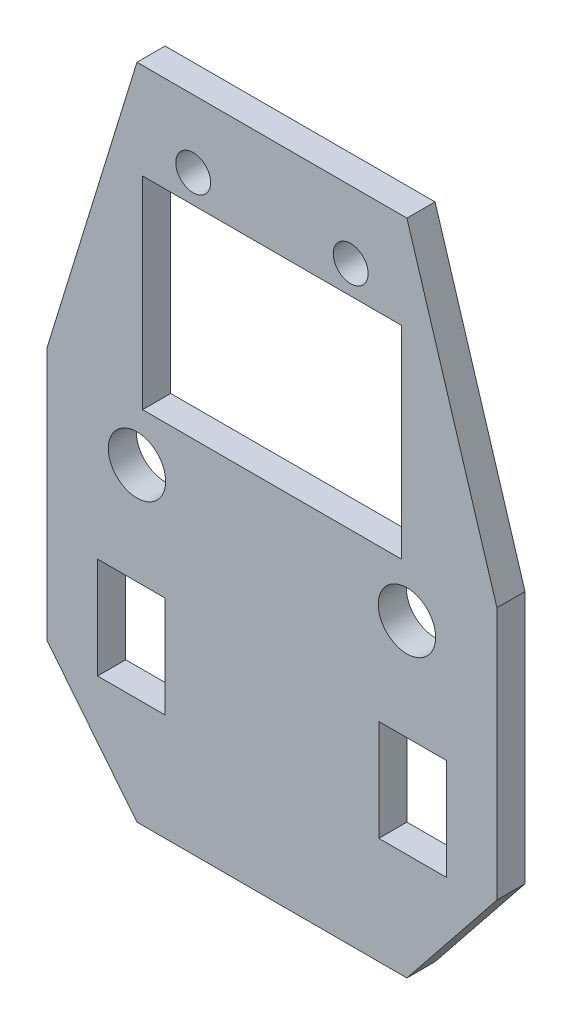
ISO-10303-21;
HEADER;
FILE_DESCRIPTION(('STEP AP214'),'2;1');
FILE_NAME('part.step','',(''),(''),'','','');
FILE_SCHEMA(('AUTOMOTIVE_DESIGN { 1 0 10303 214 1 1 1 1 }'));
ENDSEC;
DATA;
#1=APPLICATION_CONTEXT('core data for automotive mechanical design processes');
#2=APPLICATION_PROTOCOL_DEFINITION('international standard','automotive_design',2000,#1);
#3=PRODUCT_CONTEXT('',#1,'mechanical');
#4=PRODUCT('Part','Part','',(#3));
#5=PRODUCT_RELATED_PRODUCT_CATEGORY('part','',(#4));
#6=PRODUCT_DEFINITION_FORMATION('','',#4);
#7=PRODUCT_DEFINITION_CONTEXT('part definition',#1,'design');
#8=PRODUCT_DEFINITION('design','',#6,#7);
#9=PRODUCT_DEFINITION_SHAPE('','',#8);
#10=(LENGTH_UNIT() NAMED_UNIT(*) SI_UNIT(.MILLI.,.METRE.));
#11=(NAMED_UNIT(*) PLANE_ANGLE_UNIT() SI_UNIT($,.RADIAN.));
#12=(NAMED_UNIT(*) SI_UNIT($,.STERADIAN.) SOLID_ANGLE_UNIT());
#13=UNCERTAINTY_MEASURE_WITH_UNIT(LENGTH_MEASURE(1.E-05),#10,'distance_accuracy_value','');
#14=(GEOMETRIC_REPRESENTATION_CONTEXT(3) GLOBAL_UNCERTAINTY_ASSIGNED_CONTEXT((#13)) GLOBAL_UNIT_ASSIGNED_CONTEXT((#10,
#11,#12)) REPRESENTATION_CONTEXT('',''));
#15=CARTESIAN_POINT('',(0.,0.,0.));
#16=DIRECTION('',(0.,0.,1.));
#17=DIRECTION('',(1.,0.,0.));
#18=AXIS2_PLACEMENT_3D('',#15,#16,#17);
#19=CARTESIAN_POINT('',(-40.,10.,-2.5));
#20=DIRECTION('',(-1.,0.,0.));
#21=DIRECTION('',(0.,0.,1.));
#22=AXIS2_PLACEMENT_3D('',#19,#20,#21);
#23=PLANE('',#22);
#24=DIRECTION('',(0.,-1.,0.));
#25=VECTOR('',#24,1.);
#26=CARTESIAN_POINT('',(-40.,10.,2.5));
#27=LINE('',#26,#25);
#28=CARTESIAN_POINT('',(-40.,10.,2.5));
#29=VERTEX_POINT('',#28);
#30=CARTESIAN_POINT('',(-40.,-35.,2.5));
#31=VERTEX_POINT('',#30);
#32=EDGE_CURVE('E248',#29,#31,#27,.T.);
#33=ORIENTED_EDGE('',*,*,#32,.F.);
#34=DIRECTION('',(0.,0.,1.));
#35=VECTOR('',#34,1.);
#36=CARTESIAN_POINT('',(-40.,10.,-2.5));
#37=LINE('',#36,#35);
#38=CARTESIAN_POINT('',(-40.,10.,-2.5));
#39=VERTEX_POINT('',#38);
#40=EDGE_CURVE('E297',#39,#29,#37,.T.);
#41=ORIENTED_EDGE('',*,*,#40,.F.);
#42=DIRECTION('',(0.,-1.,0.));
#43=VECTOR('',#42,1.);
#44=CARTESIAN_POINT('',(-40.,10.,-2.5));
#45=LINE('',#44,#43);
#46=CARTESIAN_POINT('',(-40.,-35.,-2.5));
#47=VERTEX_POINT('',#46);
#48=EDGE_CURVE('E249',#39,#47,#45,.T.);
#49=ORIENTED_EDGE('',*,*,#48,.T.);
#50=DIRECTION('',(0.,0.,1.));
#51=VECTOR('',#50,1.);
#52=CARTESIAN_POINT('',(-40.,-35.,-2.5));
#53=LINE('',#52,#51);
#54=EDGE_CURVE('E274',#47,#31,#53,.T.);
#55=ORIENTED_EDGE('',*,*,#54,.T.);
#56=EDGE_LOOP('',(#33,#41,#49,#55));
#57=FACE_BOUND('',#56,.T.);
#58=ADVANCED_FACE('F41',(#57),#23,.T.);
#59=CARTESIAN_POINT('',(-24.,62.,-2.5));
#60=DIRECTION('',(-0.95577900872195,0.294085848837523,0.));
#61=DIRECTION('',(-0.294085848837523,-0.95577900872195,0.));
#62=AXIS2_PLACEMENT_3D('',#59,#60,#61);
#63=PLANE('',#62);
#64=DIRECTION('',(-0.294085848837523,-0.95577900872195,0.));
#65=VECTOR('',#64,1.);
#66=CARTESIAN_POINT('',(-24.,62.,2.5));
#67=LINE('',#66,#65);
#68=CARTESIAN_POINT('',(-24.,62.,2.5));
#69=VERTEX_POINT('',#68);
#70=EDGE_CURVE('E253',#69,#29,#67,.T.);
#71=ORIENTED_EDGE('',*,*,#70,.F.);
#72=DIRECTION('',(0.,0.,1.));
#73=VECTOR('',#72,1.);
#74=CARTESIAN_POINT('',(-24.,62.,-2.5));
#75=LINE('',#74,#73);
#76=CARTESIAN_POINT('',(-24.,62.,-2.5));
#77=VERTEX_POINT('',#76);
#78=EDGE_CURVE('E300',#77,#69,#75,.T.);
#79=ORIENTED_EDGE('',*,*,#78,.F.);
#80=DIRECTION('',(-0.294085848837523,-0.95577900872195,0.));
#81=VECTOR('',#80,1.);
#82=CARTESIAN_POINT('',(-24.,62.,-2.5));
#83=LINE('',#82,#81);
#84=EDGE_CURVE('E271',#77,#39,#83,.T.);
#85=ORIENTED_EDGE('',*,*,#84,.T.);
#86=ORIENTED_EDGE('',*,*,#40,.T.);
#87=EDGE_LOOP('',(#71,#79,#85,#86));
#88=FACE_BOUND('',#87,.T.);
#89=ADVANCED_FACE('F425',(#88),#63,.T.);
#90=CARTESIAN_POINT('',(24.,62.,-2.5));
#91=DIRECTION('',(0.,1.,0.));
#92=DIRECTION('',(0.,0.,1.));
#93=AXIS2_PLACEMENT_3D('',#90,#91,#92);
#94=PLANE('',#93);
#95=DIRECTION('',(-1.,0.,0.));
#96=VECTOR('',#95,1.);
#97=CARTESIAN_POINT('',(24.,62.,2.5));
#98=LINE('',#97,#96);
#99=CARTESIAN_POINT('',(24.,62.,2.5));
#100=VERTEX_POINT('',#99);
#101=EDGE_CURVE('E292',#100,#69,#98,.T.);
#102=ORIENTED_EDGE('',*,*,#101,.F.);
#103=DIRECTION('',(0.,0.,1.));
#104=VECTOR('',#103,1.);
#105=CARTESIAN_POINT('',(24.,62.,-2.5));
#106=LINE('',#105,#104);
#107=CARTESIAN_POINT('',(24.,62.,-2.5));
#108=VERTEX_POINT('',#107);
#109=EDGE_CURVE('E302',#108,#100,#106,.T.);
#110=ORIENTED_EDGE('',*,*,#109,.F.);
#111=DIRECTION('',(-1.,0.,0.));
#112=VECTOR('',#111,1.);
#113=CARTESIAN_POINT('',(24.,62.,-2.5));
#114=LINE('',#113,#112);
#115=EDGE_CURVE('E268',#108,#77,#114,.T.);
#116=ORIENTED_EDGE('',*,*,#115,.T.);
#117=ORIENTED_EDGE('',*,*,#78,.T.);
#118=EDGE_LOOP('',(#102,#110,#116,#117));
#119=FACE_BOUND('',#118,.T.);
#120=ADVANCED_FACE('F429',(#119),#94,.T.);
#121=CARTESIAN_POINT('',(40.,10.,-2.5));
#122=DIRECTION('',(0.95577900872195,0.294085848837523,0.));
#123=DIRECTION('',(-0.294085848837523,0.95577900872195,0.));
#124=AXIS2_PLACEMENT_3D('',#121,#122,#123);
#125=PLANE('',#124);
#126=DIRECTION('',(-0.294085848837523,0.95577900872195,0.));
#127=VECTOR('',#126,1.);
#128=CARTESIAN_POINT('',(40.,10.,2.5));
#129=LINE('',#128,#127);
#130=CARTESIAN_POINT('',(40.,10.,2.5));
#131=VERTEX_POINT('',#130);
#132=EDGE_CURVE('E289',#131,#100,#129,.T.);
#133=ORIENTED_EDGE('',*,*,#132,.F.);
#134=DIRECTION('',(0.,0.,1.));
#135=VECTOR('',#134,1.);
#136=CARTESIAN_POINT('',(40.,10.,-2.5));
#137=LINE('',#136,#135);
#138=CARTESIAN_POINT('',(40.,10.,-2.5));
#139=VERTEX_POINT('',#138);
#140=EDGE_CURVE('E304',#139,#131,#137,.T.);
#141=ORIENTED_EDGE('',*,*,#140,.F.);
#142=DIRECTION('',(-0.294085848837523,0.95577900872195,0.));
#143=VECTOR('',#142,1.);
#144=CARTESIAN_POINT('',(40.,10.,-2.5));
#145=LINE('',#144,#143);
#146=EDGE_CURVE('E265',#139,#108,#145,.T.);
#147=ORIENTED_EDGE('',*,*,#146,.T.);
#148=ORIENTED_EDGE('',*,*,#109,.T.);
#149=EDGE_LOOP('',(#133,#141,#147,#148));
#150=FACE_BOUND('',#149,.T.);
#151=ADVANCED_FACE('F421',(#150),#125,.T.);
#152=CARTESIAN_POINT('',(40.,-35.,-2.5));
#153=DIRECTION('',(1.,0.,0.));
#154=DIRECTION('',(0.,0.,-1.));
#155=AXIS2_PLACEMENT_3D('',#152,#153,#154);
#156=PLANE('',#155);
#157=DIRECTION('',(0.,1.,0.));
#158=VECTOR('',#157,1.);
#159=CARTESIAN_POINT('',(40.,-35.,2.5));
#160=LINE('',#159,#158);
#161=CARTESIAN_POINT('',(40.,-35.,2.5));
#162=VERTEX_POINT('',#161);
#163=EDGE_CURVE('E286',#162,#131,#160,.T.);
#164=ORIENTED_EDGE('',*,*,#163,.F.);
#165=DIRECTION('',(0.,0.,1.));
#166=VECTOR('',#165,1.);
#167=CARTESIAN_POINT('',(40.,-35.,-2.5));
#168=LINE('',#167,#166);
#169=CARTESIAN_POINT('',(40.,-35.,-2.5));
#170=VERTEX_POINT('',#169);
#171=EDGE_CURVE('E306',#170,#162,#168,.T.);
#172=ORIENTED_EDGE('',*,*,#171,.F.);
#173=DIRECTION('',(0.,1.,0.));
#174=VECTOR('',#173,1.);
#175=CARTESIAN_POINT('',(40.,-35.,-2.5));
#176=LINE('',#175,#174);
#177=EDGE_CURVE('E262',#170,#139,#176,.T.);
#178=ORIENTED_EDGE('',*,*,#177,.T.);
#179=ORIENTED_EDGE('',*,*,#140,.T.);
#180=EDGE_LOOP('',(#164,#172,#178,#179));
#181=FACE_BOUND('',#180,.T.);
#182=ADVANCED_FACE('F417',(#181),#156,.T.);
#183=CARTESIAN_POINT('',(24.,-55.,-2.5));
#184=DIRECTION('',(0.78086880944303,-0.624695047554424,0.));
#185=DIRECTION('',(0.624695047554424,0.78086880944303,0.));
#186=AXIS2_PLACEMENT_3D('',#183,#184,#185);
#187=PLANE('',#186);
#188=DIRECTION('',(0.624695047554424,0.78086880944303,0.));
#189=VECTOR('',#188,1.);
#190=CARTESIAN_POINT('',(24.,-55.,2.5));
#191=LINE('',#190,#189);
#192=CARTESIAN_POINT('',(24.,-55.,2.5));
#193=VERTEX_POINT('',#192);
#194=EDGE_CURVE('E283',#193,#162,#191,.T.);
#195=ORIENTED_EDGE('',*,*,#194,.F.);
#196=DIRECTION('',(0.,0.,1.));
#197=VECTOR('',#196,1.);
#198=CARTESIAN_POINT('',(24.,-55.,-2.5));
#199=LINE('',#198,#197);
#200=CARTESIAN_POINT('',(24.,-55.,-2.5));
#201=VERTEX_POINT('',#200);
#202=EDGE_CURVE('E308',#201,#193,#199,.T.);
#203=ORIENTED_EDGE('',*,*,#202,.F.);
#204=DIRECTION('',(0.624695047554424,0.78086880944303,0.));
#205=VECTOR('',#204,1.);
#206=CARTESIAN_POINT('',(24.,-55.,-2.5));
#207=LINE('',#206,#205);
#208=EDGE_CURVE('E259',#201,#170,#207,.T.);
#209=ORIENTED_EDGE('',*,*,#208,.T.);
#210=ORIENTED_EDGE('',*,*,#171,.T.);
#211=EDGE_LOOP('',(#195,#203,#209,#210));
#212=FACE_BOUND('',#211,.T.);
#213=ADVANCED_FACE('F413',(#212),#187,.T.);
#214=CARTESIAN_POINT('',(-24.,-55.,-2.5));
#215=DIRECTION('',(0.,-1.,0.));
#216=DIRECTION('',(0.,0.,-1.));
#217=AXIS2_PLACEMENT_3D('',#214,#215,#216);
#218=PLANE('',#217);
#219=DIRECTION('',(1.,0.,0.));
#220=VECTOR('',#219,1.);
#221=CARTESIAN_POINT('',(-24.,-55.,2.5));
#222=LINE('',#221,#220);
#223=CARTESIAN_POINT('',(-24.,-55.,2.5));
#224=VERTEX_POINT('',#223);
#225=EDGE_CURVE('E280',#224,#193,#222,.T.);
#226=ORIENTED_EDGE('',*,*,#225,.F.);
#227=DIRECTION('',(0.,0.,1.));
#228=VECTOR('',#227,1.);
#229=CARTESIAN_POINT('',(-24.,-55.,-2.5));
#230=LINE('',#229,#228);
#231=CARTESIAN_POINT('',(-24.,-55.,-2.5));
#232=VERTEX_POINT('',#231);
#233=EDGE_CURVE('E310',#232,#224,#230,.T.);
#234=ORIENTED_EDGE('',*,*,#233,.F.);
#235=DIRECTION('',(1.,0.,0.));
#236=VECTOR('',#235,1.);
#237=CARTESIAN_POINT('',(-24.,-55.,-2.5));
#238=LINE('',#237,#236);
#239=EDGE_CURVE('E256',#232,#201,#238,.T.);
#240=ORIENTED_EDGE('',*,*,#239,.T.);
#241=ORIENTED_EDGE('',*,*,#202,.T.);
#242=EDGE_LOOP('',(#226,#234,#240,#241));
#243=FACE_BOUND('',#242,.T.);
#244=ADVANCED_FACE('F409',(#243),#218,.T.);
#245=CARTESIAN_POINT('',(-40.,-35.,-2.5));
#246=DIRECTION('',(-0.78086880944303,-0.624695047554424,0.));
#247=DIRECTION('',(0.624695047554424,-0.78086880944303,0.));
#248=AXIS2_PLACEMENT_3D('',#245,#246,#247);
#249=PLANE('',#248);
#250=DIRECTION('',(0.624695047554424,-0.78086880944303,0.));
#251=VECTOR('',#250,1.);
#252=CARTESIAN_POINT('',(-40.,-35.,2.5));
#253=LINE('',#252,#251);
#254=EDGE_CURVE('E277',#31,#224,#253,.T.);
#255=ORIENTED_EDGE('',*,*,#254,.F.);
#256=ORIENTED_EDGE('',*,*,#54,.F.);
#257=DIRECTION('',(0.624695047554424,-0.78086880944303,0.));
#258=VECTOR('',#257,1.);
#259=CARTESIAN_POINT('',(-40.,-35.,-2.5));
#260=LINE('',#259,#258);
#261=EDGE_CURVE('E252',#47,#232,#260,.T.);
#262=ORIENTED_EDGE('',*,*,#261,.T.);
#263=ORIENTED_EDGE('',*,*,#233,.T.);
#264=EDGE_LOOP('',(#255,#256,#262,#263));
#265=FACE_BOUND('',#264,.T.);
#266=ADVANCED_FACE('F405',(#265),#249,.T.);
#267=CARTESIAN_POINT('',(0.,0.,-2.5));
#268=DIRECTION('',(0.,0.,1.));
#269=DIRECTION('',(1.,0.,0.));
#270=AXIS2_PLACEMENT_3D('',#267,#268,#269);
#271=PLANE('',#270);
#272=DIRECTION('',(1.,0.,0.));
#273=VECTOR('',#272,1.);
#274=CARTESIAN_POINT('',(0.,9.,-2.5));
#275=LINE('',#274,#273);
#276=CARTESIAN_POINT('',(-23.,9.,-2.5));
#277=VERTEX_POINT('',#276);
#278=CARTESIAN_POINT('',(23.,9.,-2.5));
#279=VERTEX_POINT('',#278);
#280=EDGE_CURVE('E226',#277,#279,#275,.T.);
#281=ORIENTED_EDGE('',*,*,#280,.T.);
#282=DIRECTION('',(0.,1.,0.));
#283=VECTOR('',#282,1.);
#284=CARTESIAN_POINT('',(23.,0.,-2.5));
#285=LINE('',#284,#283);
#286=CARTESIAN_POINT('',(23.,45.,-2.5));
#287=VERTEX_POINT('',#286);
#288=EDGE_CURVE('E229',#279,#287,#285,.T.);
#289=ORIENTED_EDGE('',*,*,#288,.T.);
#290=DIRECTION('',(-1.,0.,0.));
#291=VECTOR('',#290,1.);
#292=CARTESIAN_POINT('',(0.,45.,-2.5));
#293=LINE('',#292,#291);
#294=CARTESIAN_POINT('',(-23.,45.,-2.5));
#295=VERTEX_POINT('',#294);
#296=EDGE_CURVE('E220',#287,#295,#293,.T.);
#297=ORIENTED_EDGE('',*,*,#296,.T.);
#298=DIRECTION('',(0.,-1.,0.));
#299=VECTOR('',#298,1.);
#300=CARTESIAN_POINT('',(-23.,0.,-2.5));
#301=LINE('',#300,#299);
#302=EDGE_CURVE('E223',#295,#277,#301,.T.);
#303=ORIENTED_EDGE('',*,*,#302,.T.);
#304=EDGE_LOOP('',(#281,#289,#297,#303));
#305=FACE_BOUND('',#304,.T.);
#306=DIRECTION('',(1.,0.,0.));
#307=VECTOR('',#306,1.);
#308=CARTESIAN_POINT('',(0.,-36.,-2.5));
#309=LINE('',#308,#307);
#310=CARTESIAN_POINT('',(-31.,-36.,-2.5));
#311=VERTEX_POINT('',#310);
#312=CARTESIAN_POINT('',(-19.,-36.,-2.5));
#313=VERTEX_POINT('',#312);
#314=EDGE_CURVE('E214',#311,#313,#309,.T.);
#315=ORIENTED_EDGE('',*,*,#314,.T.);
#316=DIRECTION('',(0.,1.,0.));
#317=VECTOR('',#316,1.);
#318=CARTESIAN_POINT('',(-19.,0.,-2.5));
#319=LINE('',#318,#317);
#320=CARTESIAN_POINT('',(-19.,-18.,-2.5));
#321=VERTEX_POINT('',#320);
#322=EDGE_CURVE('E217',#313,#321,#319,.T.);
#323=ORIENTED_EDGE('',*,*,#322,.T.);
#324=DIRECTION('',(-1.,0.,0.));
#325=VECTOR('',#324,1.);
#326=CARTESIAN_POINT('',(0.,-18.,-2.5));
#327=LINE('',#326,#325);
#328=CARTESIAN_POINT('',(-31.,-18.,-2.5));
#329=VERTEX_POINT('',#328);
#330=EDGE_CURVE('E204',#321,#329,#327,.T.);
#331=ORIENTED_EDGE('',*,*,#330,.T.);
#332=DIRECTION('',(0.,-1.,0.));
#333=VECTOR('',#332,1.);
#334=CARTESIAN_POINT('',(-31.,0.,-2.5));
#335=LINE('',#334,#333);
#336=EDGE_CURVE('E207',#329,#311,#335,.T.);
#337=ORIENTED_EDGE('',*,*,#336,.T.);
#338=EDGE_LOOP('',(#315,#323,#331,#337));
#339=FACE_BOUND('',#338,.T.);
#340=DIRECTION('',(1.,0.,0.));
#341=VECTOR('',#340,1.);
#342=CARTESIAN_POINT('',(0.,-36.,-2.5));
#343=LINE('',#342,#341);
#344=CARTESIAN_POINT('',(19.,-36.,-2.5));
#345=VERTEX_POINT('',#344);
#346=CARTESIAN_POINT('',(31.,-36.,-2.5));
#347=VERTEX_POINT('',#346);
#348=EDGE_CURVE('E203',#345,#347,#343,.T.);
#349=ORIENTED_EDGE('',*,*,#348,.T.);
#350=DIRECTION('',(0.,1.,0.));
#351=VECTOR('',#350,1.);
#352=CARTESIAN_POINT('',(31.,0.,-2.5));
#353=LINE('',#352,#351);
#354=CARTESIAN_POINT('',(31.,-18.,-2.5));
#355=VERTEX_POINT('',#354);
#356=EDGE_CURVE('E193',#347,#355,#353,.T.);
#357=ORIENTED_EDGE('',*,*,#356,.T.);
#358=DIRECTION('',(-1.,0.,0.));
#359=VECTOR('',#358,1.);
#360=CARTESIAN_POINT('',(0.,-18.,-2.5));
#361=LINE('',#360,#359);
#362=CARTESIAN_POINT('',(19.,-18.,-2.5));
#363=VERTEX_POINT('',#362);
#364=EDGE_CURVE('E176',#355,#363,#361,.T.);
#365=ORIENTED_EDGE('',*,*,#364,.T.);
#366=DIRECTION('',(0.,-1.,0.));
#367=VECTOR('',#366,1.);
#368=CARTESIAN_POINT('',(19.,0.,-2.5));
#369=LINE('',#368,#367);
#370=EDGE_CURVE('E187',#363,#345,#369,.T.);
#371=ORIENTED_EDGE('',*,*,#370,.T.);
#372=EDGE_LOOP('',(#349,#357,#365,#371));
#373=FACE_BOUND('',#372,.T.);
#374=CARTESIAN_POINT('',(-24.,0.,-2.5));
#375=DIRECTION('',(0.,0.,1.));
#376=DIRECTION('',(1.,0.,0.));
#377=AXIS2_PLACEMENT_3D('',#374,#375,#376);
#378=CIRCLE('',#377,5.1);
#379=CARTESIAN_POINT('',(-18.9,0.,-2.5));
#380=VERTEX_POINT('',#379);
#381=EDGE_CURVE('E245',#380,#380,#378,.T.);
#382=ORIENTED_EDGE('',*,*,#381,.T.);
#383=EDGE_LOOP('',(#382));
#384=FACE_BOUND('',#383,.T.);
#385=CARTESIAN_POINT('',(14.,50.,-2.5));
#386=DIRECTION('',(0.,0.,1.));
#387=DIRECTION('',(1.,0.,0.));
#388=AXIS2_PLACEMENT_3D('',#385,#386,#387);
#389=CIRCLE('',#388,3.1);
#390=CARTESIAN_POINT('',(17.1,50.,-2.5));
#391=VERTEX_POINT('',#390);
#392=EDGE_CURVE('E241',#391,#391,#389,.T.);
#393=ORIENTED_EDGE('',*,*,#392,.T.);
#394=EDGE_LOOP('',(#393));
#395=FACE_BOUND('',#394,.T.);
#396=CARTESIAN_POINT('',(-14.,50.,-2.5));
#397=DIRECTION('',(0.,0.,1.));
#398=DIRECTION('',(1.,0.,0.));
#399=AXIS2_PLACEMENT_3D('',#396,#397,#398);
#400=CIRCLE('',#399,3.1);
#401=CARTESIAN_POINT('',(-10.9,50.,-2.5));
#402=VERTEX_POINT('',#401);
#403=EDGE_CURVE('E237',#402,#402,#400,.T.);
#404=ORIENTED_EDGE('',*,*,#403,.T.);
#405=EDGE_LOOP('',(#404));
#406=FACE_BOUND('',#405,.T.);
#407=CARTESIAN_POINT('',(24.,0.,-2.5));
#408=DIRECTION('',(0.,0.,1.));
#409=DIRECTION('',(1.,0.,0.));
#410=AXIS2_PLACEMENT_3D('',#407,#408,#409);
#411=CIRCLE('',#410,5.1);
#412=CARTESIAN_POINT('',(29.1,0.,-2.5));
#413=VERTEX_POINT('',#412);
#414=EDGE_CURVE('E233',#413,#413,#411,.T.);
#415=ORIENTED_EDGE('',*,*,#414,.T.);
#416=EDGE_LOOP('',(#415));
#417=FACE_BOUND('',#416,.T.);
#418=ORIENTED_EDGE('',*,*,#48,.F.);
#419=ORIENTED_EDGE('',*,*,#84,.F.);
#420=ORIENTED_EDGE('',*,*,#115,.F.);
#421=ORIENTED_EDGE('',*,*,#146,.F.);
#422=ORIENTED_EDGE('',*,*,#177,.F.);
#423=ORIENTED_EDGE('',*,*,#208,.F.);
#424=ORIENTED_EDGE('',*,*,#239,.F.);
#425=ORIENTED_EDGE('',*,*,#261,.F.);
#426=EDGE_LOOP('',(#418,#419,#420,#421,#422,#423,#424,#425));
#427=FACE_BOUND('',#426,.T.);
#428=ADVANCED_FACE('F201',(#305,#339,#373,#384,#395,#406,#417,#427),#271,.F.);
#429=CARTESIAN_POINT('',(0.,0.,2.5));
#430=DIRECTION('',(0.,0.,1.));
#431=DIRECTION('',(1.,0.,0.));
#432=AXIS2_PLACEMENT_3D('',#429,#430,#431);
#433=PLANE('',#432);
#434=DIRECTION('',(0.,1.,0.));
#435=VECTOR('',#434,1.);
#436=CARTESIAN_POINT('',(23.,0.,2.5));
#437=LINE('',#436,#435);
#438=CARTESIAN_POINT('',(23.,9.,2.5));
#439=VERTEX_POINT('',#438);
#440=CARTESIAN_POINT('',(23.,45.,2.5));
#441=VERTEX_POINT('',#440);
#442=EDGE_CURVE('E11',#439,#441,#437,.T.);
#443=ORIENTED_EDGE('',*,*,#442,.F.);
#444=DIRECTION('',(1.,0.,0.));
#445=VECTOR('',#444,1.);
#446=CARTESIAN_POINT('',(0.,9.,2.5));
#447=LINE('',#446,#445);
#448=CARTESIAN_POINT('',(-23.,9.,2.5));
#449=VERTEX_POINT('',#448);
#450=EDGE_CURVE('E48',#449,#439,#447,.T.);
#451=ORIENTED_EDGE('',*,*,#450,.F.);
#452=DIRECTION('',(0.,-1.,0.));
#453=VECTOR('',#452,1.);
#454=CARTESIAN_POINT('',(-23.,0.,2.5));
#455=LINE('',#454,#453);
#456=CARTESIAN_POINT('',(-23.,45.,2.5));
#457=VERTEX_POINT('',#456);
#458=EDGE_CURVE('E338',#457,#449,#455,.T.);
#459=ORIENTED_EDGE('',*,*,#458,.F.);
#460=DIRECTION('',(-1.,0.,0.));
#461=VECTOR('',#460,1.);
#462=CARTESIAN_POINT('',(0.,45.,2.5));
#463=LINE('',#462,#461);
#464=EDGE_CURVE('E336',#441,#457,#463,.T.);
#465=ORIENTED_EDGE('',*,*,#464,.F.);
#466=EDGE_LOOP('',(#443,#451,#459,#465));
#467=FACE_BOUND('',#466,.T.);
#468=DIRECTION('',(0.,1.,0.));
#469=VECTOR('',#468,1.);
#470=CARTESIAN_POINT('',(-19.,0.,2.5));
#471=LINE('',#470,#469);
#472=CARTESIAN_POINT('',(-19.,-36.,2.5));
#473=VERTEX_POINT('',#472);
#474=CARTESIAN_POINT('',(-19.,-18.,2.5));
#475=VERTEX_POINT('',#474);
#476=EDGE_CURVE('E333',#473,#475,#471,.T.);
#477=ORIENTED_EDGE('',*,*,#476,.F.);
#478=DIRECTION('',(1.,0.,0.));
#479=VECTOR('',#478,1.);
#480=CARTESIAN_POINT('',(0.,-36.,2.5));
#481=LINE('',#480,#479);
#482=CARTESIAN_POINT('',(-31.,-36.,2.5));
#483=VERTEX_POINT('',#482);
#484=EDGE_CURVE('E331',#483,#473,#481,.T.);
#485=ORIENTED_EDGE('',*,*,#484,.F.);
#486=DIRECTION('',(0.,-1.,0.));
#487=VECTOR('',#486,1.);
#488=CARTESIAN_POINT('',(-31.,0.,2.5));
#489=LINE('',#488,#487);
#490=CARTESIAN_POINT('',(-31.,-18.,2.5));
#491=VERTEX_POINT('',#490);
#492=EDGE_CURVE('E329',#491,#483,#489,.T.);
#493=ORIENTED_EDGE('',*,*,#492,.F.);
#494=DIRECTION('',(-1.,0.,0.));
#495=VECTOR('',#494,1.);
#496=CARTESIAN_POINT('',(0.,-18.,2.5));
#497=LINE('',#496,#495);
#498=EDGE_CURVE('E327',#475,#491,#497,.T.);
#499=ORIENTED_EDGE('',*,*,#498,.F.);
#500=EDGE_LOOP('',(#477,#485,#493,#499));
#501=FACE_BOUND('',#500,.T.);
#502=DIRECTION('',(0.,1.,0.));
#503=VECTOR('',#502,1.);
#504=CARTESIAN_POINT('',(31.,0.,2.5));
#505=LINE('',#504,#503);
#506=CARTESIAN_POINT('',(31.,-36.,2.5));
#507=VERTEX_POINT('',#506);
#508=CARTESIAN_POINT('',(31.,-18.,2.5));
#509=VERTEX_POINT('',#508);
#510=EDGE_CURVE('E196',#507,#509,#505,.T.);
#511=ORIENTED_EDGE('',*,*,#510,.F.);
#512=DIRECTION('',(1.,0.,0.));
#513=VECTOR('',#512,1.);
#514=CARTESIAN_POINT('',(0.,-36.,2.5));
#515=LINE('',#514,#513);
#516=CARTESIAN_POINT('',(19.,-36.,2.5));
#517=VERTEX_POINT('',#516);
#518=EDGE_CURVE('E324',#517,#507,#515,.T.);
#519=ORIENTED_EDGE('',*,*,#518,.F.);
#520=DIRECTION('',(0.,-1.,0.));
#521=VECTOR('',#520,1.);
#522=CARTESIAN_POINT('',(19.,0.,2.5));
#523=LINE('',#522,#521);
#524=CARTESIAN_POINT('',(19.,-18.,2.5));
#525=VERTEX_POINT('',#524);
#526=EDGE_CURVE('E322',#525,#517,#523,.T.);
#527=ORIENTED_EDGE('',*,*,#526,.F.);
#528=DIRECTION('',(-1.,0.,0.));
#529=VECTOR('',#528,1.);
#530=CARTESIAN_POINT('',(0.,-18.,2.5));
#531=LINE('',#530,#529);
#532=EDGE_CURVE('E299',#509,#525,#531,.T.);
#533=ORIENTED_EDGE('',*,*,#532,.F.);
#534=EDGE_LOOP('',(#511,#519,#527,#533));
#535=FACE_BOUND('',#534,.T.);
#536=CARTESIAN_POINT('',(-24.,0.,2.5));
#537=DIRECTION('',(0.,0.,1.));
#538=DIRECTION('',(1.,0.,0.));
#539=AXIS2_PLACEMENT_3D('',#536,#537,#538);
#540=CIRCLE('',#539,5.1);
#541=CARTESIAN_POINT('',(-18.9,0.,2.5));
#542=VERTEX_POINT('',#541);
#543=EDGE_CURVE('E244',#542,#542,#540,.T.);
#544=ORIENTED_EDGE('',*,*,#543,.F.);
#545=EDGE_LOOP('',(#544));
#546=FACE_BOUND('',#545,.T.);
#547=CARTESIAN_POINT('',(14.,50.,2.5));
#548=DIRECTION('',(0.,0.,1.));
#549=DIRECTION('',(1.,0.,0.));
#550=AXIS2_PLACEMENT_3D('',#547,#548,#549);
#551=CIRCLE('',#550,3.1);
#552=CARTESIAN_POINT('',(17.1,50.,2.5));
#553=VERTEX_POINT('',#552);
#554=EDGE_CURVE('E240',#553,#553,#551,.T.);
#555=ORIENTED_EDGE('',*,*,#554,.F.);
#556=EDGE_LOOP('',(#555));
#557=FACE_BOUND('',#556,.T.);
#558=CARTESIAN_POINT('',(-14.,50.,2.5));
#559=DIRECTION('',(0.,0.,1.));
#560=DIRECTION('',(1.,0.,0.));
#561=AXIS2_PLACEMENT_3D('',#558,#559,#560);
#562=CIRCLE('',#561,3.1);
#563=CARTESIAN_POINT('',(-10.9,50.,2.5));
#564=VERTEX_POINT('',#563);
#565=EDGE_CURVE('E236',#564,#564,#562,.T.);
#566=ORIENTED_EDGE('',*,*,#565,.F.);
#567=EDGE_LOOP('',(#566));
#568=FACE_BOUND('',#567,.T.);
#569=CARTESIAN_POINT('',(24.,0.,2.5));
#570=DIRECTION('',(0.,0.,1.));
#571=DIRECTION('',(1.,0.,0.));
#572=AXIS2_PLACEMENT_3D('',#569,#570,#571);
#573=CIRCLE('',#572,5.1);
#574=CARTESIAN_POINT('',(29.1,0.,2.5));
#575=VERTEX_POINT('',#574);
#576=EDGE_CURVE('E232',#575,#575,#573,.T.);
#577=ORIENTED_EDGE('',*,*,#576,.F.);
#578=EDGE_LOOP('',(#577));
#579=FACE_BOUND('',#578,.T.);
#580=ORIENTED_EDGE('',*,*,#32,.T.);
#581=ORIENTED_EDGE('',*,*,#254,.T.);
#582=ORIENTED_EDGE('',*,*,#225,.T.);
#583=ORIENTED_EDGE('',*,*,#194,.T.);
#584=ORIENTED_EDGE('',*,*,#163,.T.);
#585=ORIENTED_EDGE('',*,*,#132,.T.);
#586=ORIENTED_EDGE('',*,*,#101,.T.);
#587=ORIENTED_EDGE('',*,*,#70,.T.);
#588=EDGE_LOOP('',(#580,#581,#582,#583,#584,#585,#586,#587));
#589=FACE_BOUND('',#588,.T.);
#590=ADVANCED_FACE('F355',(#467,#501,#535,#546,#557,#568,#579,#589),#433,.T.);
#591=CARTESIAN_POINT('',(24.,0.,-250.));
#592=DIRECTION('',(0.,0.,1.));
#593=DIRECTION('',(1.,0.,0.));
#594=AXIS2_PLACEMENT_3D('',#591,#592,#593);
#595=CYLINDRICAL_SURFACE('',#594,5.1);
#596=ORIENTED_EDGE('',*,*,#576,.T.);
#597=EDGE_LOOP('',(#596));
#598=FACE_BOUND('',#597,.T.);
#599=ORIENTED_EDGE('',*,*,#414,.F.);
#600=EDGE_LOOP('',(#599));
#601=FACE_BOUND('',#600,.T.);
#602=ADVANCED_FACE('F388',(#598,#601),#595,.F.);
#603=CARTESIAN_POINT('',(-14.,50.,-250.));
#604=DIRECTION('',(0.,0.,1.));
#605=DIRECTION('',(1.,0.,0.));
#606=AXIS2_PLACEMENT_3D('',#603,#604,#605);
#607=CYLINDRICAL_SURFACE('',#606,3.1);
#608=ORIENTED_EDGE('',*,*,#565,.T.);
#609=EDGE_LOOP('',(#608));
#610=FACE_BOUND('',#609,.T.);
#611=ORIENTED_EDGE('',*,*,#403,.F.);
#612=EDGE_LOOP('',(#611));
#613=FACE_BOUND('',#612,.T.);
#614=ADVANCED_FACE('F514',(#610,#613),#607,.F.);
#615=CARTESIAN_POINT('',(14.,50.,-250.));
#616=DIRECTION('',(0.,0.,1.));
#617=DIRECTION('',(1.,0.,0.));
#618=AXIS2_PLACEMENT_3D('',#615,#616,#617);
#619=CYLINDRICAL_SURFACE('',#618,3.1);
#620=ORIENTED_EDGE('',*,*,#554,.T.);
#621=EDGE_LOOP('',(#620));
#622=FACE_BOUND('',#621,.T.);
#623=ORIENTED_EDGE('',*,*,#392,.F.);
#624=EDGE_LOOP('',(#623));
#625=FACE_BOUND('',#624,.T.);
#626=ADVANCED_FACE('F524',(#622,#625),#619,.F.);
#627=CARTESIAN_POINT('',(-24.,0.,-250.));
#628=DIRECTION('',(0.,0.,1.));
#629=DIRECTION('',(1.,0.,0.));
#630=AXIS2_PLACEMENT_3D('',#627,#628,#629);
#631=CYLINDRICAL_SURFACE('',#630,5.1);
#632=ORIENTED_EDGE('',*,*,#543,.T.);
#633=EDGE_LOOP('',(#632));
#634=FACE_BOUND('',#633,.T.);
#635=ORIENTED_EDGE('',*,*,#381,.F.);
#636=EDGE_LOOP('',(#635));
#637=FACE_BOUND('',#636,.T.);
#638=ADVANCED_FACE('F534',(#634,#637),#631,.F.);
#639=CARTESIAN_POINT('',(31.,-36.,-250.));
#640=DIRECTION('',(1.,0.,0.));
#641=DIRECTION('',(0.,0.,-1.));
#642=AXIS2_PLACEMENT_3D('',#639,#640,#641);
#643=PLANE('',#642);
#644=DIRECTION('',(0.,0.,1.));
#645=VECTOR('',#644,1.);
#646=CARTESIAN_POINT('',(31.,-36.,-250.));
#647=LINE('',#646,#645);
#648=EDGE_CURVE('E377',#347,#507,#647,.T.);
#649=ORIENTED_EDGE('',*,*,#648,.T.);
#650=ORIENTED_EDGE('',*,*,#510,.T.);
#651=DIRECTION('',(0.,0.,1.));
#652=VECTOR('',#651,1.);
#653=CARTESIAN_POINT('',(31.,-18.,-250.));
#654=LINE('',#653,#652);
#655=EDGE_CURVE('E179',#355,#509,#654,.T.);
#656=ORIENTED_EDGE('',*,*,#655,.F.);
#657=ORIENTED_EDGE('',*,*,#356,.F.);
#658=EDGE_LOOP('',(#649,#650,#656,#657));
#659=FACE_BOUND('',#658,.T.);
#660=ADVANCED_FACE('F192',(#659),#643,.F.);
#661=CARTESIAN_POINT('',(19.,-36.,-250.));
#662=DIRECTION('',(0.,-1.,0.));
#663=DIRECTION('',(0.,0.,-1.));
#664=AXIS2_PLACEMENT_3D('',#661,#662,#663);
#665=PLANE('',#664);
#666=DIRECTION('',(0.,0.,1.));
#667=VECTOR('',#666,1.);
#668=CARTESIAN_POINT('',(19.,-36.,-250.));
#669=LINE('',#668,#667);
#670=EDGE_CURVE('E374',#345,#517,#669,.T.);
#671=ORIENTED_EDGE('',*,*,#670,.T.);
#672=ORIENTED_EDGE('',*,*,#518,.T.);
#673=ORIENTED_EDGE('',*,*,#648,.F.);
#674=ORIENTED_EDGE('',*,*,#348,.F.);
#675=EDGE_LOOP('',(#671,#672,#673,#674));
#676=FACE_BOUND('',#675,.T.);
#677=ADVANCED_FACE('F384',(#676),#665,.F.);
#678=CARTESIAN_POINT('',(19.,-36.,-250.));
#679=DIRECTION('',(-1.,0.,0.));
#680=DIRECTION('',(0.,0.,1.));
#681=AXIS2_PLACEMENT_3D('',#678,#679,#680);
#682=PLANE('',#681);
#683=DIRECTION('',(0.,0.,1.));
#684=VECTOR('',#683,1.);
#685=CARTESIAN_POINT('',(19.,-18.,-250.));
#686=LINE('',#685,#684);
#687=EDGE_CURVE('E182',#363,#525,#686,.T.);
#688=ORIENTED_EDGE('',*,*,#687,.T.);
#689=ORIENTED_EDGE('',*,*,#526,.T.);
#690=ORIENTED_EDGE('',*,*,#670,.F.);
#691=ORIENTED_EDGE('',*,*,#370,.F.);
#692=EDGE_LOOP('',(#688,#689,#690,#691));
#693=FACE_BOUND('',#692,.T.);
#694=ADVANCED_FACE('F380',(#693),#682,.F.);
#695=CARTESIAN_POINT('',(19.,-18.,-250.));
#696=DIRECTION('',(0.,1.,0.));
#697=DIRECTION('',(0.,0.,1.));
#698=AXIS2_PLACEMENT_3D('',#695,#696,#697);
#699=PLANE('',#698);
#700=ORIENTED_EDGE('',*,*,#655,.T.);
#701=ORIENTED_EDGE('',*,*,#532,.T.);
#702=ORIENTED_EDGE('',*,*,#687,.F.);
#703=ORIENTED_EDGE('',*,*,#364,.F.);
#704=EDGE_LOOP('',(#700,#701,#702,#703));
#705=FACE_BOUND('',#704,.T.);
#706=ADVANCED_FACE('F178',(#705),#699,.F.);
#707=CARTESIAN_POINT('',(-19.,-36.,-250.));
#708=DIRECTION('',(1.,0.,0.));
#709=DIRECTION('',(0.,0.,-1.));
#710=AXIS2_PLACEMENT_3D('',#707,#708,#709);
#711=PLANE('',#710);
#712=DIRECTION('',(0.,0.,1.));
#713=VECTOR('',#712,1.);
#714=CARTESIAN_POINT('',(-19.,-36.,-250.));
#715=LINE('',#714,#713);
#716=EDGE_CURVE('E198',#313,#473,#715,.T.);
#717=ORIENTED_EDGE('',*,*,#716,.T.);
#718=ORIENTED_EDGE('',*,*,#476,.T.);
#719=DIRECTION('',(0.,0.,1.));
#720=VECTOR('',#719,1.);
#721=CARTESIAN_POINT('',(-19.,-18.,-250.));
#722=LINE('',#721,#720);
#723=EDGE_CURVE('E363',#321,#475,#722,.T.);
#724=ORIENTED_EDGE('',*,*,#723,.F.);
#725=ORIENTED_EDGE('',*,*,#322,.F.);
#726=EDGE_LOOP('',(#717,#718,#724,#725));
#727=FACE_BOUND('',#726,.T.);
#728=ADVANCED_FACE('F575',(#727),#711,.F.);
#729=CARTESIAN_POINT('',(-31.,-36.,-250.));
#730=DIRECTION('',(0.,-1.,0.));
#731=DIRECTION('',(0.,0.,-1.));
#732=AXIS2_PLACEMENT_3D('',#729,#730,#731);
#733=PLANE('',#732);
#734=DIRECTION('',(0.,0.,1.));
#735=VECTOR('',#734,1.);
#736=CARTESIAN_POINT('',(-31.,-36.,-250.));
#737=LINE('',#736,#735);
#738=EDGE_CURVE('E368',#311,#483,#737,.T.);
#739=ORIENTED_EDGE('',*,*,#738,.T.);
#740=ORIENTED_EDGE('',*,*,#484,.T.);
#741=ORIENTED_EDGE('',*,*,#716,.F.);
#742=ORIENTED_EDGE('',*,*,#314,.F.);
#743=EDGE_LOOP('',(#739,#740,#741,#742));
#744=FACE_BOUND('',#743,.T.);
#745=ADVANCED_FACE('F584',(#744),#733,.F.);
#746=CARTESIAN_POINT('',(-31.,-36.,-250.));
#747=DIRECTION('',(-1.,0.,0.));
#748=DIRECTION('',(0.,0.,1.));
#749=AXIS2_PLACEMENT_3D('',#746,#747,#748);
#750=PLANE('',#749);
#751=DIRECTION('',(0.,0.,1.));
#752=VECTOR('',#751,1.);
#753=CARTESIAN_POINT('',(-31.,-18.,-250.));
#754=LINE('',#753,#752);
#755=EDGE_CURVE('E63',#329,#491,#754,.T.);
#756=ORIENTED_EDGE('',*,*,#755,.T.);
#757=ORIENTED_EDGE('',*,*,#492,.T.);
#758=ORIENTED_EDGE('',*,*,#738,.F.);
#759=ORIENTED_EDGE('',*,*,#336,.F.);
#760=EDGE_LOOP('',(#756,#757,#758,#759));
#761=FACE_BOUND('',#760,.T.);
#762=ADVANCED_FACE('F594',(#761),#750,.F.);
#763=CARTESIAN_POINT('',(-31.,-18.,-250.));
#764=DIRECTION('',(0.,1.,0.));
#765=DIRECTION('',(0.,0.,1.));
#766=AXIS2_PLACEMENT_3D('',#763,#764,#765);
#767=PLANE('',#766);
#768=ORIENTED_EDGE('',*,*,#723,.T.);
#769=ORIENTED_EDGE('',*,*,#498,.T.);
#770=ORIENTED_EDGE('',*,*,#755,.F.);
#771=ORIENTED_EDGE('',*,*,#330,.F.);
#772=EDGE_LOOP('',(#768,#769,#770,#771));
#773=FACE_BOUND('',#772,.T.);
#774=ADVANCED_FACE('F604',(#773),#767,.F.);
#775=CARTESIAN_POINT('',(23.,9.,-250.));
#776=DIRECTION('',(1.,0.,0.));
#777=DIRECTION('',(0.,0.,-1.));
#778=AXIS2_PLACEMENT_3D('',#775,#776,#777);
#779=PLANE('',#778);
#780=DIRECTION('',(0.,0.,1.));
#781=VECTOR('',#780,1.);
#782=CARTESIAN_POINT('',(23.,9.,-250.));
#783=LINE('',#782,#781);
#784=EDGE_CURVE('E188',#279,#439,#783,.T.);
#785=ORIENTED_EDGE('',*,*,#784,.T.);
#786=ORIENTED_EDGE('',*,*,#442,.T.);
#787=DIRECTION('',(0.,0.,1.));
#788=VECTOR('',#787,1.);
#789=CARTESIAN_POINT('',(23.,45.,-250.));
#790=LINE('',#789,#788);
#791=EDGE_CURVE('E358',#287,#441,#790,.T.);
#792=ORIENTED_EDGE('',*,*,#791,.F.);
#793=ORIENTED_EDGE('',*,*,#288,.F.);
#794=EDGE_LOOP('',(#785,#786,#792,#793));
#795=FACE_BOUND('',#794,.T.);
#796=ADVANCED_FACE('F351',(#795),#779,.F.);
#797=CARTESIAN_POINT('',(-23.,9.,-250.));
#798=DIRECTION('',(0.,-1.,0.));
#799=DIRECTION('',(0.,0.,-1.));
#800=AXIS2_PLACEMENT_3D('',#797,#798,#799);
#801=PLANE('',#800);
#802=DIRECTION('',(0.,0.,1.));
#803=VECTOR('',#802,1.);
#804=CARTESIAN_POINT('',(-23.,9.,-250.));
#805=LINE('',#804,#803);
#806=EDGE_CURVE('E346',#277,#449,#805,.T.);
#807=ORIENTED_EDGE('',*,*,#806,.T.);
#808=ORIENTED_EDGE('',*,*,#450,.T.);
#809=ORIENTED_EDGE('',*,*,#784,.F.);
#810=ORIENTED_EDGE('',*,*,#280,.F.);
#811=EDGE_LOOP('',(#807,#808,#809,#810));
#812=FACE_BOUND('',#811,.T.);
#813=ADVANCED_FACE('F344',(#812),#801,.F.);
#814=CARTESIAN_POINT('',(-23.,9.,-250.));
#815=DIRECTION('',(-1.,0.,0.));
#816=DIRECTION('',(0.,0.,1.));
#817=AXIS2_PLACEMENT_3D('',#814,#815,#816);
#818=PLANE('',#817);
#819=DIRECTION('',(0.,0.,1.));
#820=VECTOR('',#819,1.);
#821=CARTESIAN_POINT('',(-23.,45.,-250.));
#822=LINE('',#821,#820);
#823=EDGE_CURVE('E55',#295,#457,#822,.T.);
#824=ORIENTED_EDGE('',*,*,#823,.T.);
#825=ORIENTED_EDGE('',*,*,#458,.T.);
#826=ORIENTED_EDGE('',*,*,#806,.F.);
#827=ORIENTED_EDGE('',*,*,#302,.F.);
#828=EDGE_LOOP('',(#824,#825,#826,#827));
#829=FACE_BOUND('',#828,.T.);
#830=ADVANCED_FACE('F360',(#829),#818,.F.);
#831=CARTESIAN_POINT('',(-23.,45.,-250.));
#832=DIRECTION('',(0.,1.,0.));
#833=DIRECTION('',(0.,0.,1.));
#834=AXIS2_PLACEMENT_3D('',#831,#832,#833);
#835=PLANE('',#834);
#836=ORIENTED_EDGE('',*,*,#791,.T.);
#837=ORIENTED_EDGE('',*,*,#464,.T.);
#838=ORIENTED_EDGE('',*,*,#823,.F.);
#839=ORIENTED_EDGE('',*,*,#296,.F.);
#840=EDGE_LOOP('',(#836,#837,#838,#839));
#841=FACE_BOUND('',#840,.T.);
#842=ADVANCED_FACE('F357',(#841),#835,.F.);
#843=CLOSED_SHELL('',(#58,#89,#120,#151,#182,#213,#244,#266,#428,#590,#602,#614,#626,#638,#660,
#677,#694,#706,#728,#745,#762,#774,#796,#813,#830,#842));
#844=MANIFOLD_SOLID_BREP('B2',#843);
#845=ADVANCED_BREP_SHAPE_REPRESENTATION('',(#18,#844),#14);
#846=SHAPE_DEFINITION_REPRESENTATION(#9,#845);
ENDSEC;
END-ISO-10303-21;
